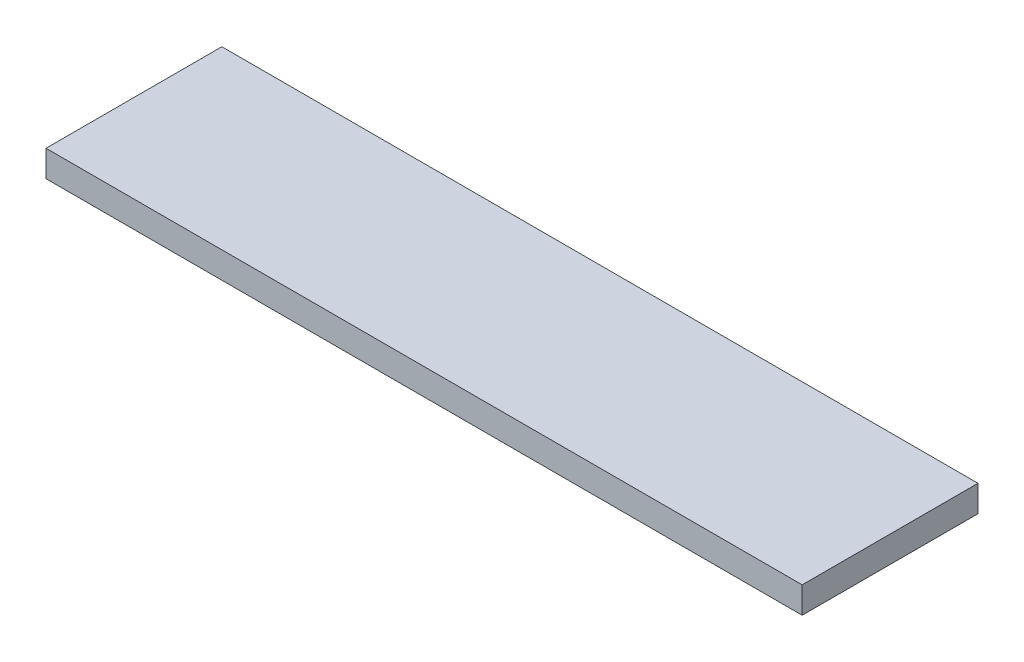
ISO-10303-21;
HEADER;
FILE_DESCRIPTION(('STEP AP214'),'2;1');
FILE_NAME('part.step','',(''),(''),'','','');
FILE_SCHEMA(('AUTOMOTIVE_DESIGN { 1 0 10303 214 1 1 1 1 }'));
ENDSEC;
DATA;
#1=APPLICATION_CONTEXT('core data for automotive mechanical design processes');
#2=APPLICATION_PROTOCOL_DEFINITION('international standard','automotive_design',2000,#1);
#3=PRODUCT_CONTEXT('',#1,'mechanical');
#4=PRODUCT('Part','Part','',(#3));
#5=PRODUCT_RELATED_PRODUCT_CATEGORY('part','',(#4));
#6=PRODUCT_DEFINITION_FORMATION('','',#4);
#7=PRODUCT_DEFINITION_CONTEXT('part definition',#1,'design');
#8=PRODUCT_DEFINITION('design','',#6,#7);
#9=PRODUCT_DEFINITION_SHAPE('','',#8);
#10=(LENGTH_UNIT() NAMED_UNIT(*) SI_UNIT(.MILLI.,.METRE.));
#11=(NAMED_UNIT(*) PLANE_ANGLE_UNIT() SI_UNIT($,.RADIAN.));
#12=(NAMED_UNIT(*) SI_UNIT($,.STERADIAN.) SOLID_ANGLE_UNIT());
#13=UNCERTAINTY_MEASURE_WITH_UNIT(LENGTH_MEASURE(1.E-05),#10,'distance_accuracy_value','');
#14=(GEOMETRIC_REPRESENTATION_CONTEXT(3) GLOBAL_UNCERTAINTY_ASSIGNED_CONTEXT((#13)) GLOBAL_UNIT_ASSIGNED_CONTEXT((#10,
#11,#12)) REPRESENTATION_CONTEXT('',''));
#15=CARTESIAN_POINT('',(0.,0.,0.));
#16=DIRECTION('',(0.,0.,1.));
#17=DIRECTION('',(1.,0.,0.));
#18=AXIS2_PLACEMENT_3D('',#15,#16,#17);
#19=CARTESIAN_POINT('',(-4.5,-0.01,-5.));
#20=DIRECTION('',(0.,0.,1.));
#21=DIRECTION('',(1.,0.,0.));
#22=AXIS2_PLACEMENT_3D('',#19,#20,#21);
#23=PLANE('',#22);
#24=DIRECTION('',(1.,0.,0.));
#25=VECTOR('',#24,1.);
#26=CARTESIAN_POINT('',(0.,0.,-5.));
#27=LINE('',#26,#25);
#28=CARTESIAN_POINT('',(-21.5,0.,-5.));
#29=VERTEX_POINT('',#28);
#30=CARTESIAN_POINT('',(21.5,0.,-5.));
#31=VERTEX_POINT('',#30);
#32=EDGE_CURVE('E44',#29,#31,#27,.T.);
#33=ORIENTED_EDGE('',*,*,#32,.F.);
#34=DIRECTION('',(0.,1.,0.));
#35=VECTOR('',#34,1.);
#36=CARTESIAN_POINT('',(-21.5,-0.01,-5.));
#37=LINE('',#36,#35);
#38=CARTESIAN_POINT('',(-21.5,1.5,-5.));
#39=VERTEX_POINT('',#38);
#40=EDGE_CURVE('E39',#29,#39,#37,.T.);
#41=ORIENTED_EDGE('',*,*,#40,.T.);
#42=DIRECTION('',(1.,0.,0.));
#43=VECTOR('',#42,1.);
#44=CARTESIAN_POINT('',(0.,1.5,-5.));
#45=LINE('',#44,#43);
#46=CARTESIAN_POINT('',(21.5,1.5,-5.));
#47=VERTEX_POINT('',#46);
#48=EDGE_CURVE('E96',#39,#47,#45,.T.);
#49=ORIENTED_EDGE('',*,*,#48,.T.);
#50=DIRECTION('',(0.,1.,0.));
#51=VECTOR('',#50,1.);
#52=CARTESIAN_POINT('',(21.5,-0.01,-5.));
#53=LINE('',#52,#51);
#54=EDGE_CURVE('E79',#31,#47,#53,.T.);
#55=ORIENTED_EDGE('',*,*,#54,.F.);
#56=EDGE_LOOP('',(#33,#41,#49,#55));
#57=FACE_BOUND('',#56,.T.);
#58=ADVANCED_FACE('F35',(#57),#23,.F.);
#59=CARTESIAN_POINT('',(21.5,-0.01,5.));
#60=DIRECTION('',(0.,0.,-1.));
#61=DIRECTION('',(-1.,0.,0.));
#62=AXIS2_PLACEMENT_3D('',#59,#60,#61);
#63=PLANE('',#62);
#64=DIRECTION('',(0.,1.,0.));
#65=VECTOR('',#64,1.);
#66=CARTESIAN_POINT('',(21.5,-0.01,5.));
#67=LINE('',#66,#65);
#68=CARTESIAN_POINT('',(21.5,0.,5.));
#69=VERTEX_POINT('',#68);
#70=CARTESIAN_POINT('',(21.5,1.5,5.));
#71=VERTEX_POINT('',#70);
#72=EDGE_CURVE('E92',#69,#71,#67,.T.);
#73=ORIENTED_EDGE('',*,*,#72,.T.);
#74=DIRECTION('',(-1.,0.,0.));
#75=VECTOR('',#74,1.);
#76=CARTESIAN_POINT('',(0.,1.5,5.));
#77=LINE('',#76,#75);
#78=CARTESIAN_POINT('',(-21.5,1.5,5.));
#79=VERTEX_POINT('',#78);
#80=EDGE_CURVE('E99',#71,#79,#77,.T.);
#81=ORIENTED_EDGE('',*,*,#80,.T.);
#82=DIRECTION('',(0.,1.,0.));
#83=VECTOR('',#82,1.);
#84=CARTESIAN_POINT('',(-21.5,-0.01,5.));
#85=LINE('',#84,#83);
#86=CARTESIAN_POINT('',(-21.5,0.,5.));
#87=VERTEX_POINT('',#86);
#88=EDGE_CURVE('E91',#87,#79,#85,.T.);
#89=ORIENTED_EDGE('',*,*,#88,.F.);
#90=DIRECTION('',(-1.,0.,0.));
#91=VECTOR('',#90,1.);
#92=CARTESIAN_POINT('',(0.,0.,5.));
#93=LINE('',#92,#91);
#94=EDGE_CURVE('E11',#69,#87,#93,.T.);
#95=ORIENTED_EDGE('',*,*,#94,.F.);
#96=EDGE_LOOP('',(#73,#81,#89,#95));
#97=FACE_BOUND('',#96,.T.);
#98=ADVANCED_FACE('F108',(#97),#63,.F.);
#99=CARTESIAN_POINT('',(21.5,-0.01,5.));
#100=DIRECTION('',(-1.,0.,0.));
#101=DIRECTION('',(0.,0.,1.));
#102=AXIS2_PLACEMENT_3D('',#99,#100,#101);
#103=PLANE('',#102);
#104=ORIENTED_EDGE('',*,*,#54,.T.);
#105=DIRECTION('',(0.,0.,1.));
#106=VECTOR('',#105,1.);
#107=CARTESIAN_POINT('',(21.5,1.5,0.));
#108=LINE('',#107,#106);
#109=EDGE_CURVE('E101',#47,#71,#108,.T.);
#110=ORIENTED_EDGE('',*,*,#109,.T.);
#111=ORIENTED_EDGE('',*,*,#72,.F.);
#112=DIRECTION('',(0.,0.,1.));
#113=VECTOR('',#112,1.);
#114=CARTESIAN_POINT('',(21.5,0.,0.));
#115=LINE('',#114,#113);
#116=EDGE_CURVE('E86',#31,#69,#115,.T.);
#117=ORIENTED_EDGE('',*,*,#116,.F.);
#118=EDGE_LOOP('',(#104,#110,#111,#117));
#119=FACE_BOUND('',#118,.T.);
#120=ADVANCED_FACE('F106',(#119),#103,.F.);
#121=CARTESIAN_POINT('',(-21.5,-0.01,5.));
#122=DIRECTION('',(1.,0.,0.));
#123=DIRECTION('',(0.,0.,-1.));
#124=AXIS2_PLACEMENT_3D('',#121,#122,#123);
#125=PLANE('',#124);
#126=ORIENTED_EDGE('',*,*,#88,.T.);
#127=DIRECTION('',(0.,0.,-1.));
#128=VECTOR('',#127,1.);
#129=CARTESIAN_POINT('',(-21.5,1.5,0.));
#130=LINE('',#129,#128);
#131=EDGE_CURVE('E90',#79,#39,#130,.T.);
#132=ORIENTED_EDGE('',*,*,#131,.T.);
#133=ORIENTED_EDGE('',*,*,#40,.F.);
#134=DIRECTION('',(0.,0.,-1.));
#135=VECTOR('',#134,1.);
#136=CARTESIAN_POINT('',(-21.5,0.,0.));
#137=LINE('',#136,#135);
#138=EDGE_CURVE('E80',#87,#29,#137,.T.);
#139=ORIENTED_EDGE('',*,*,#138,.F.);
#140=EDGE_LOOP('',(#126,#132,#133,#139));
#141=FACE_BOUND('',#140,.T.);
#142=ADVANCED_FACE('F88',(#141),#125,.F.);
#143=CARTESIAN_POINT('',(0.,0.,0.));
#144=DIRECTION('',(0.,1.,0.));
#145=DIRECTION('',(0.,0.,1.));
#146=AXIS2_PLACEMENT_3D('',#143,#144,#145);
#147=PLANE('',#146);
#148=ORIENTED_EDGE('',*,*,#32,.T.);
#149=ORIENTED_EDGE('',*,*,#116,.T.);
#150=ORIENTED_EDGE('',*,*,#94,.T.);
#151=ORIENTED_EDGE('',*,*,#138,.T.);
#152=EDGE_LOOP('',(#148,#149,#150,#151));
#153=FACE_BOUND('',#152,.T.);
#154=ADVANCED_FACE('F83',(#153),#147,.F.);
#155=CARTESIAN_POINT('',(0.,1.5,0.));
#156=DIRECTION('',(0.,1.,0.));
#157=DIRECTION('',(0.,0.,1.));
#158=AXIS2_PLACEMENT_3D('',#155,#156,#157);
#159=PLANE('',#158);
#160=ORIENTED_EDGE('',*,*,#109,.F.);
#161=ORIENTED_EDGE('',*,*,#48,.F.);
#162=ORIENTED_EDGE('',*,*,#131,.F.);
#163=ORIENTED_EDGE('',*,*,#80,.F.);
#164=EDGE_LOOP('',(#160,#161,#162,#163));
#165=FACE_BOUND('',#164,.T.);
#166=ADVANCED_FACE('F37',(#165),#159,.T.);
#167=CLOSED_SHELL('',(#58,#98,#120,#142,#154,#166));
#168=MANIFOLD_SOLID_BREP('B2',#167);
#169=ADVANCED_BREP_SHAPE_REPRESENTATION('',(#18,#168),#14);
#170=SHAPE_DEFINITION_REPRESENTATION(#9,#169);
ENDSEC;
END-ISO-10303-21;
